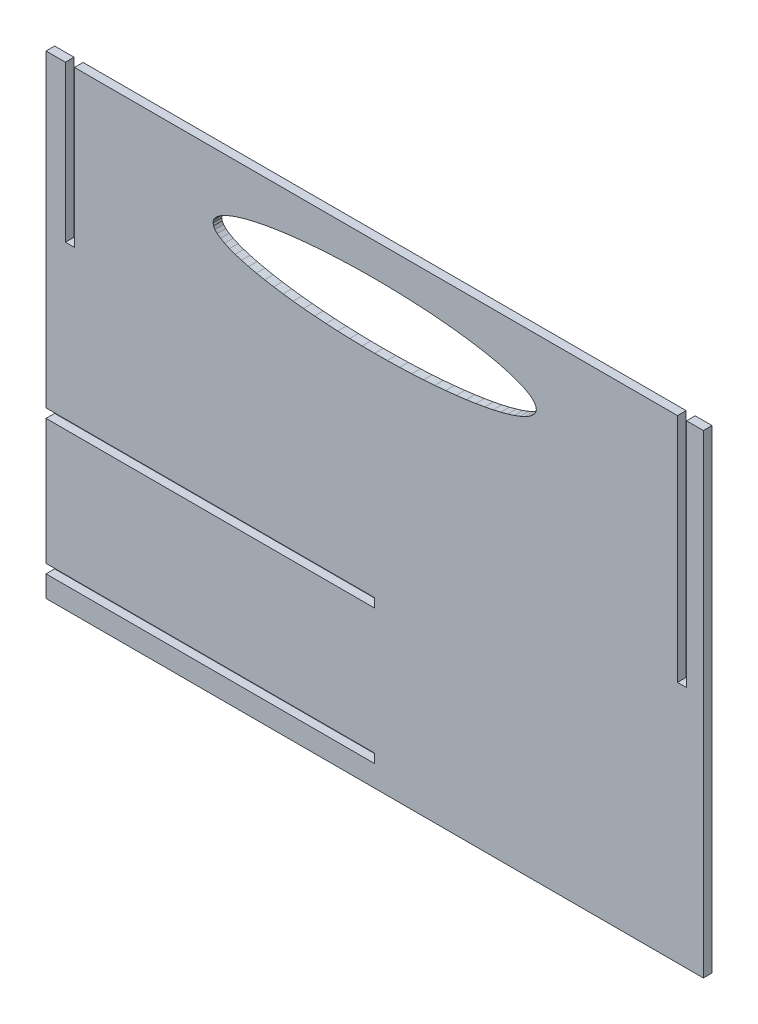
from build123d import *

# Parameters (mm, degrees)
EXTRUDE_1_DEPTH = 4


with BuildPart() as part:
    # Model → Extrude 1 (new body)
    with BuildSketch(Plane.XY):
        Polygon((-1955.8066, -1141.3763), (-1955.8066, -997.9528), (-1946.8022, -997.9528), (-1946.8022, -1070.3008), (-1946.7022, -1070.3008), (-1942.7023, -1070.3008), (-1942.6022, -1070.3008), (-1942.6022, -997.9528), (-1662.8024, -997.9528), (-1662.8024, -1105.1696), (-1662.7024, -1105.1696), (-1658.7024, -1105.1696), (-1658.6024, -1105.1696), (-1658.6024, -997.9528), (-1650.8067, -997.9528), (-1650.8067, -1217.9527), (-1955.8066, -1217.9527), (-1955.8066, -1208.0527), (-1803.325, -1208.0527), (-1803.325, -1207.9526), (-1803.325, -1203.9526), (-1803.325, -1203.8527), (-1955.8066, -1203.8527), (-1955.8066, -1145.5763), (-1803.325, -1145.5763), (-1803.325, -1145.4763), (-1803.325, -1141.4763), (-1803.325, -1141.3763), align=None)
        Polygon((-1791.7164, -1043.0194), (-1786.1217, -1042.8014), (-1780.6829, -1042.5019), (-1775.4167, -1042.1243), (-1770.34, -1041.672), (-1765.4694, -1041.1483), (-1760.8218, -1040.5566), (-1756.4138, -1039.9002), (-1752.2622, -1039.1825), (-1748.3837, -1038.4068), (-1744.7952, -1037.5765), (-1741.5133, -1036.6949), (-1738.5548, -1035.7654), (-1735.9365, -1034.7913), (-1733.675, -1033.7759), (-1731.7871, -1032.7227), (-1730.2896, -1031.6349), (-1729.1992, -1030.516), (-1728.5327, -1029.3692), (-1728.3068, -1028.1979), (-1728.5327, -1027.0267), (-1729.1992, -1025.8799), (-1730.2896, -1024.7609), (-1731.7871, -1023.6732), (-1733.675, -1022.6199), (-1735.9365, -1021.6046), (-1738.5548, -1020.6305), (-1741.5133, -1019.7009), (-1744.7952, -1018.8193), (-1748.3837, -1017.989), (-1752.2622, -1017.2133), (-1756.4138, -1016.4956), (-1760.8218, -1015.8392), (-1765.4694, -1015.2475), (-1770.34, -1014.7238), (-1775.4167, -1014.2715), (-1780.6829, -1013.894), (-1786.1217, -1013.5945), (-1791.7164, -1013.3764), (-1797.4504, -1013.2431), (-1803.3067, -1013.1979), (-1809.1631, -1013.2431), (-1814.897, -1013.3764), (-1820.4918, -1013.5945), (-1825.9306, -1013.894), (-1831.1967, -1014.2715), (-1836.2735, -1014.7238), (-1841.1441, -1015.2475), (-1845.7917, -1015.8392), (-1850.1997, -1016.4956), (-1854.3513, -1017.2133), (-1858.2298, -1017.989), (-1861.8183, -1018.8193), (-1865.1002, -1019.7009), (-1868.0587, -1020.6305), (-1870.6771, -1021.6046), (-1872.9386, -1022.6199), (-1874.8265, -1023.6731), (-1876.324, -1024.7609), (-1877.4143, -1025.8798), (-1878.0808, -1027.0266), (-1878.3067, -1028.1979), (-1878.0808, -1029.3692), (-1877.4143, -1030.516), (-1876.324, -1031.6349), (-1874.8265, -1032.7227), (-1872.9386, -1033.7759), (-1870.6771, -1034.7913), (-1868.0587, -1035.7654), (-1865.1002, -1036.6949), (-1861.8183, -1037.5765), (-1858.2298, -1038.4068), (-1854.3513, -1039.1825), (-1850.1997, -1039.9002), (-1845.7917, -1040.5566), (-1841.1441, -1041.1483), (-1836.2735, -1041.672), (-1831.1967, -1042.1243), (-1825.9306, -1042.5019), (-1820.4918, -1042.8014), (-1814.897, -1043.0194), (-1809.1631, -1043.1527), (-1803.3067, -1043.1979), (-1797.4504, -1043.1527), align=None, mode=Mode.SUBTRACT)
    extrude(amount=EXTRUDE_1_DEPTH)


solid = part.part
